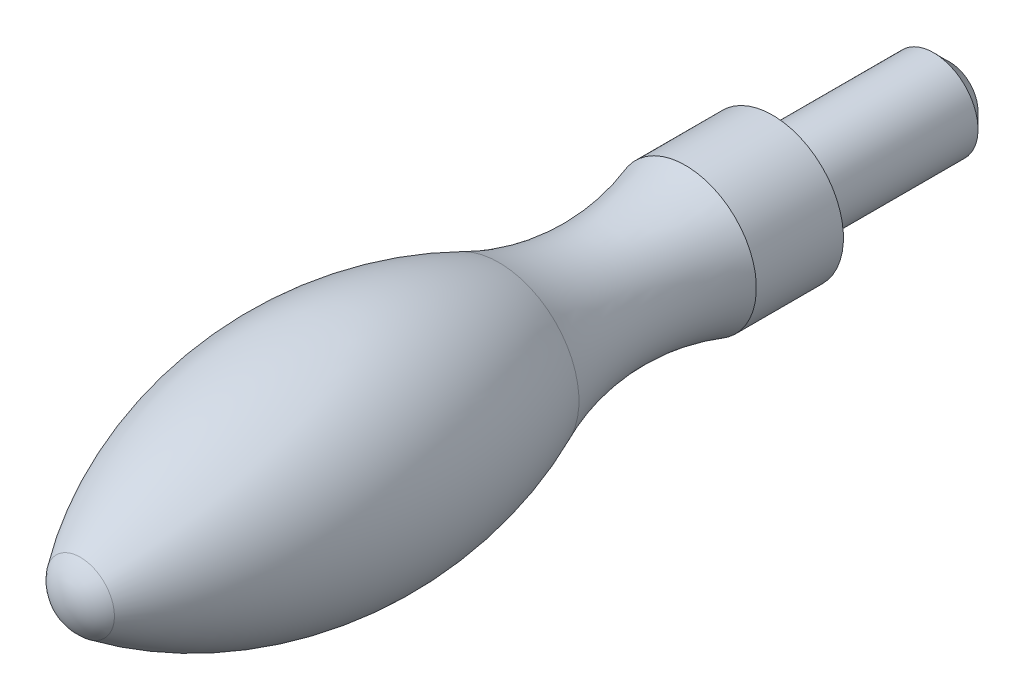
ISO-10303-21;
HEADER;
FILE_DESCRIPTION(('STEP AP214'),'2;1');
FILE_NAME('part.step','',(''),(''),'','','');
FILE_SCHEMA(('AUTOMOTIVE_DESIGN { 1 0 10303 214 1 1 1 1 }'));
ENDSEC;
DATA;
#1=APPLICATION_CONTEXT('core data for automotive mechanical design processes');
#2=APPLICATION_PROTOCOL_DEFINITION('international standard','automotive_design',2000,#1);
#3=PRODUCT_CONTEXT('',#1,'mechanical');
#4=PRODUCT('Part','Part','',(#3));
#5=PRODUCT_RELATED_PRODUCT_CATEGORY('part','',(#4));
#6=PRODUCT_DEFINITION_FORMATION('','',#4);
#7=PRODUCT_DEFINITION_CONTEXT('part definition',#1,'design');
#8=PRODUCT_DEFINITION('design','',#6,#7);
#9=PRODUCT_DEFINITION_SHAPE('','',#8);
#10=(LENGTH_UNIT() NAMED_UNIT(*) SI_UNIT(.MILLI.,.METRE.));
#11=(NAMED_UNIT(*) PLANE_ANGLE_UNIT() SI_UNIT($,.RADIAN.));
#12=(NAMED_UNIT(*) SI_UNIT($,.STERADIAN.) SOLID_ANGLE_UNIT());
#13=UNCERTAINTY_MEASURE_WITH_UNIT(LENGTH_MEASURE(1.E-05),#10,'distance_accuracy_value','');
#14=(GEOMETRIC_REPRESENTATION_CONTEXT(3) GLOBAL_UNCERTAINTY_ASSIGNED_CONTEXT((#13)) GLOBAL_UNIT_ASSIGNED_CONTEXT((#10,
#11,#12)) REPRESENTATION_CONTEXT('',''));
#15=CARTESIAN_POINT('',(0.,0.,0.));
#16=DIRECTION('',(0.,0.,1.));
#17=DIRECTION('',(1.,0.,0.));
#18=AXIS2_PLACEMENT_3D('',#15,#16,#17);
#19=CARTESIAN_POINT('',(0.,0.,37.5));
#20=DIRECTION('',(-1.,0.,0.));
#21=DIRECTION('',(0.,0.,1.));
#22=AXIS2_PLACEMENT_3D('',#19,#20,#21);
#23=SPHERICAL_SURFACE('',#22,2.5);
#24=CARTESIAN_POINT('',(0.,0.,37.5));
#25=DIRECTION('',(0.,0.,-1.));
#26=DIRECTION('',(-1.,0.,0.));
#27=AXIS2_PLACEMENT_3D('',#24,#25,#26);
#28=SPHERICAL_SURFACE('',#27,2.5);
#29=CARTESIAN_POINT('',(0.,0.,39.0957932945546));
#30=DIRECTION('',(0.,0.,-1.));
#31=DIRECTION('',(-1.,0.,0.));
#32=AXIS2_PLACEMENT_3D('',#29,#30,#31);
#33=CIRCLE('',#32,1.92443336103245);
#34=CARTESIAN_POINT('',(-1.92443336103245,0.,39.0957932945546));
#35=VERTEX_POINT('',#34);
#36=EDGE_CURVE('E23',#35,#35,#33,.T.);
#37=ORIENTED_EDGE('',*,*,#36,.F.);
#38=EDGE_LOOP('',(#37));
#39=FACE_BOUND('',#38,.T.);
#40=ADVANCED_FACE('F12',(#39),#28,.T.);
#41=CARTESIAN_POINT('',(0.,0.,25.));
#42=DIRECTION('',(0.,0.,-1.));
#43=DIRECTION('',(-1.,0.,0.));
#44=AXIS2_PLACEMENT_3D('',#41,#42,#43);
#45=DEGENERATE_TOROIDAL_SURFACE('',#44,17.5,24.,.F.);
#46=CARTESIAN_POINT('',(0.,0.,15.456067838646));
#47=DIRECTION('',(0.,0.,-1.));
#48=DIRECTION('',(-1.,0.,0.));
#49=AXIS2_PLACEMENT_3D('',#46,#47,#48);
#50=CIRCLE('',#49,4.52074837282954);
#51=CARTESIAN_POINT('',(-4.52074837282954,0.,15.456067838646));
#52=VERTEX_POINT('',#51);
#53=EDGE_CURVE('E27',#52,#52,#50,.T.);
#54=ORIENTED_EDGE('',*,*,#53,.F.);
#55=EDGE_LOOP('',(#54));
#56=FACE_BOUND('',#55,.T.);
#57=ORIENTED_EDGE('',*,*,#36,.T.);
#58=EDGE_LOOP('',(#57));
#59=FACE_BOUND('',#58,.T.);
#60=ADVANCED_FACE('F61',(#56,#59),#45,.F.);
#61=CARTESIAN_POINT('',(0.,0.,9.52));
#62=DIRECTION('',(0.,0.,-1.));
#63=DIRECTION('',(-1.,0.,0.));
#64=AXIS2_PLACEMENT_3D('',#61,#62,#63);
#65=TOROIDAL_SURFACE('',#64,17.75,14.5);
#66=ORIENTED_EDGE('',*,*,#53,.T.);
#67=EDGE_LOOP('',(#66));
#68=FACE_BOUND('',#67,.T.);
#69=CARTESIAN_POINT('',(0.,0.,4.9170118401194));
#70=DIRECTION('',(0.,0.,-1.));
#71=DIRECTION('',(-1.,0.,0.));
#72=AXIS2_PLACEMENT_3D('',#69,#70,#71);
#73=CIRCLE('',#72,4.);
#74=CARTESIAN_POINT('',(-4.,0.,4.9170118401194));
#75=VERTEX_POINT('',#74);
#76=EDGE_CURVE('E32',#75,#75,#73,.T.);
#77=ORIENTED_EDGE('',*,*,#76,.F.);
#78=EDGE_LOOP('',(#77));
#79=FACE_BOUND('',#78,.T.);
#80=ADVANCED_FACE('F57',(#68,#79),#65,.F.);
#81=CARTESIAN_POINT('',(0.,0.,-12.5));
#82=DIRECTION('',(0.,0.,-1.));
#83=DIRECTION('',(-1.,0.,0.));
#84=AXIS2_PLACEMENT_3D('',#81,#82,#83);
#85=CYLINDRICAL_SURFACE('',#84,4.);
#86=CARTESIAN_POINT('',(0.,0.,0.));
#87=DIRECTION('',(0.,0.,-1.));
#88=DIRECTION('',(-1.,0.,0.));
#89=AXIS2_PLACEMENT_3D('',#86,#87,#88);
#90=CIRCLE('',#89,4.);
#91=CARTESIAN_POINT('',(-4.,0.,0.));
#92=VERTEX_POINT('',#91);
#93=EDGE_CURVE('E35',#92,#92,#90,.T.);
#94=ORIENTED_EDGE('',*,*,#93,.F.);
#95=EDGE_LOOP('',(#94));
#96=FACE_BOUND('',#95,.T.);
#97=ORIENTED_EDGE('',*,*,#76,.T.);
#98=EDGE_LOOP('',(#97));
#99=FACE_BOUND('',#98,.T.);
#100=ADVANCED_FACE('F46',(#96,#99),#85,.T.);
#101=CARTESIAN_POINT('',(0.,2.5,0.));
#102=DIRECTION('',(0.,0.,-1.));
#103=DIRECTION('',(-1.,0.,0.));
#104=AXIS2_PLACEMENT_3D('',#101,#102,#103);
#105=PLANE('',#104);
#106=ORIENTED_EDGE('',*,*,#93,.T.);
#107=EDGE_LOOP('',(#106));
#108=FACE_BOUND('',#107,.T.);
#109=CARTESIAN_POINT('',(0.,0.,0.));
#110=DIRECTION('',(0.,0.,-1.));
#111=DIRECTION('',(-1.,0.,0.));
#112=AXIS2_PLACEMENT_3D('',#109,#110,#111);
#113=CIRCLE('',#112,2.5);
#114=CARTESIAN_POINT('',(-2.5,0.,0.));
#115=VERTEX_POINT('',#114);
#116=EDGE_CURVE('E38',#115,#115,#113,.T.);
#117=ORIENTED_EDGE('',*,*,#116,.F.);
#118=EDGE_LOOP('',(#117));
#119=FACE_BOUND('',#118,.T.);
#120=ADVANCED_FACE('F44',(#108,#119),#105,.T.);
#121=CARTESIAN_POINT('',(0.,0.,-12.5));
#122=DIRECTION('',(0.,0.,-1.));
#123=DIRECTION('',(-1.,0.,0.));
#124=AXIS2_PLACEMENT_3D('',#121,#122,#123);
#125=CYLINDRICAL_SURFACE('',#124,2.5);
#126=CARTESIAN_POINT('',(0.,0.,-9.1));
#127=DIRECTION('',(0.,0.,-1.));
#128=DIRECTION('',(-1.,0.,0.));
#129=AXIS2_PLACEMENT_3D('',#126,#127,#128);
#130=CIRCLE('',#129,2.5);
#131=CARTESIAN_POINT('',(-2.5,0.,-9.1));
#132=VERTEX_POINT('',#131);
#133=EDGE_CURVE('E8',#132,#132,#130,.F.);
#134=ORIENTED_EDGE('',*,*,#133,.T.);
#135=EDGE_LOOP('',(#134));
#136=FACE_BOUND('',#135,.T.);
#137=ORIENTED_EDGE('',*,*,#116,.T.);
#138=EDGE_LOOP('',(#137));
#139=FACE_BOUND('',#138,.T.);
#140=ADVANCED_FACE('F42',(#136,#139),#125,.T.);
#141=CARTESIAN_POINT('',(0.,0.,-10.));
#142=DIRECTION('',(0.,0.,-1.));
#143=DIRECTION('',(-1.,0.,0.));
#144=AXIS2_PLACEMENT_3D('',#141,#142,#143);
#145=PLANE('',#144);
#146=CARTESIAN_POINT('',(0.,0.,-10.));
#147=DIRECTION('',(0.,0.,-1.));
#148=DIRECTION('',(-1.,0.,0.));
#149=AXIS2_PLACEMENT_3D('',#146,#147,#148);
#150=CIRCLE('',#149,1.6);
#151=CARTESIAN_POINT('',(-1.6,0.,-10.));
#152=VERTEX_POINT('',#151);
#153=EDGE_CURVE('E19',#152,#152,#150,.T.);
#154=ORIENTED_EDGE('',*,*,#153,.T.);
#155=EDGE_LOOP('',(#154));
#156=FACE_BOUND('',#155,.T.);
#157=ADVANCED_FACE('F55',(#156),#145,.T.);
#158=CARTESIAN_POINT('',(0.,0.,-10.));
#159=DIRECTION('',(0.,0.,1.));
#160=DIRECTION('',(1.,0.,0.));
#161=AXIS2_PLACEMENT_3D('',#158,#159,#160);
#162=CONICAL_SURFACE('',#161,1.6,0.785398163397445);
#163=ORIENTED_EDGE('',*,*,#133,.F.);
#164=EDGE_LOOP('',(#163));
#165=FACE_BOUND('',#164,.T.);
#166=ORIENTED_EDGE('',*,*,#153,.F.);
#167=EDGE_LOOP('',(#166));
#168=FACE_BOUND('',#167,.T.);
#169=ADVANCED_FACE('F14',(#165,#168),#162,.T.);
#170=CLOSED_SHELL('',(#40,#60,#80,#100,#120,#140,#157,#169));
#171=MANIFOLD_SOLID_BREP('B1',#170);
#172=ADVANCED_BREP_SHAPE_REPRESENTATION('',(#18,#171),#14);
#173=SHAPE_DEFINITION_REPRESENTATION(#9,#172);
ENDSEC;
END-ISO-10303-21;
